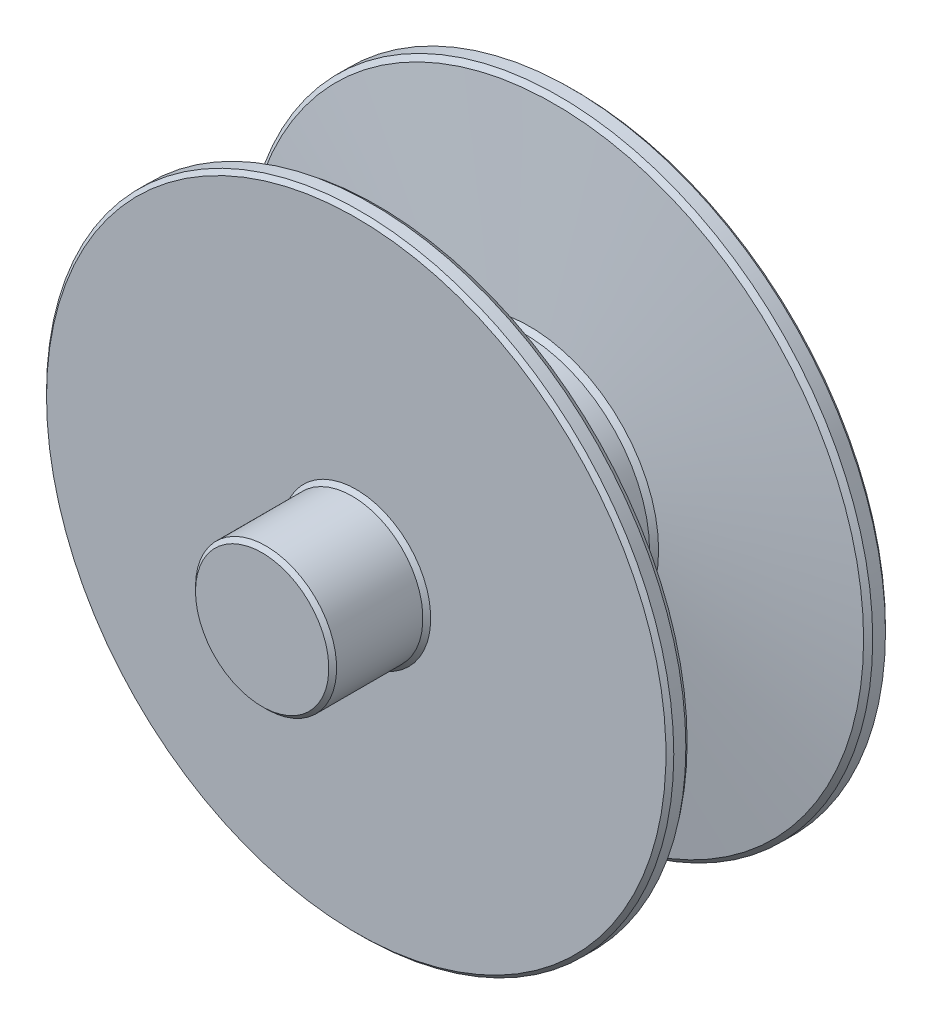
ISO-10303-21;
HEADER;
FILE_DESCRIPTION(('STEP AP214'),'2;1');
FILE_NAME('part.step','',(''),(''),'','','');
FILE_SCHEMA(('AUTOMOTIVE_DESIGN { 1 0 10303 214 1 1 1 1 }'));
ENDSEC;
DATA;
#1=APPLICATION_CONTEXT('core data for automotive mechanical design processes');
#2=APPLICATION_PROTOCOL_DEFINITION('international standard','automotive_design',2000,#1);
#3=PRODUCT_CONTEXT('',#1,'mechanical');
#4=PRODUCT('Part','Part','',(#3));
#5=PRODUCT_RELATED_PRODUCT_CATEGORY('part','',(#4));
#6=PRODUCT_DEFINITION_FORMATION('','',#4);
#7=PRODUCT_DEFINITION_CONTEXT('part definition',#1,'design');
#8=PRODUCT_DEFINITION('design','',#6,#7);
#9=PRODUCT_DEFINITION_SHAPE('','',#8);
#10=(LENGTH_UNIT() NAMED_UNIT(*) SI_UNIT(.MILLI.,.METRE.));
#11=(NAMED_UNIT(*) PLANE_ANGLE_UNIT() SI_UNIT($,.RADIAN.));
#12=(NAMED_UNIT(*) SI_UNIT($,.STERADIAN.) SOLID_ANGLE_UNIT());
#13=UNCERTAINTY_MEASURE_WITH_UNIT(LENGTH_MEASURE(1.E-05),#10,'distance_accuracy_value','');
#14=(GEOMETRIC_REPRESENTATION_CONTEXT(3) GLOBAL_UNCERTAINTY_ASSIGNED_CONTEXT((#13)) GLOBAL_UNIT_ASSIGNED_CONTEXT((#10,
#11,#12)) REPRESENTATION_CONTEXT('',''));
#15=CARTESIAN_POINT('',(0.,0.,0.));
#16=DIRECTION('',(0.,0.,1.));
#17=DIRECTION('',(1.,0.,0.));
#18=AXIS2_PLACEMENT_3D('',#15,#16,#17);
#19=CARTESIAN_POINT('',(0.,4.5,0.));
#20=DIRECTION('',(0.,0.,-1.));
#21=DIRECTION('',(-1.,0.,0.));
#22=AXIS2_PLACEMENT_3D('',#19,#20,#21);
#23=PLANE('',#22);
#24=CARTESIAN_POINT('',(0.,0.,0.));
#25=DIRECTION('',(0.,0.,-1.));
#26=DIRECTION('',(-1.,0.,0.));
#27=AXIS2_PLACEMENT_3D('',#24,#25,#26);
#28=CIRCLE('',#27,4.25);
#29=CARTESIAN_POINT('',(-4.25,0.,0.));
#30=VERTEX_POINT('',#29);
#31=EDGE_CURVE('E10',#30,#30,#28,.F.);
#32=ORIENTED_EDGE('',*,*,#31,.T.);
#33=EDGE_LOOP('',(#32));
#34=FACE_BOUND('',#33,.T.);
#35=ADVANCED_FACE('F29',(#34),#23,.F.);
#36=CARTESIAN_POINT('',(0.,0.,-26.));
#37=DIRECTION('',(0.,0.,1.));
#38=DIRECTION('',(1.,0.,0.));
#39=AXIS2_PLACEMENT_3D('',#36,#37,#38);
#40=PLANE('',#39);
#41=CARTESIAN_POINT('',(0.,0.,-26.));
#42=DIRECTION('',(0.,0.,1.));
#43=DIRECTION('',(1.,0.,0.));
#44=AXIS2_PLACEMENT_3D('',#41,#42,#43);
#45=CIRCLE('',#44,4.25);
#46=CARTESIAN_POINT('',(4.25,0.,-26.));
#47=VERTEX_POINT('',#46);
#48=EDGE_CURVE('E44',#47,#47,#45,.F.);
#49=ORIENTED_EDGE('',*,*,#48,.T.);
#50=EDGE_LOOP('',(#49));
#51=FACE_BOUND('',#50,.T.);
#52=ADVANCED_FACE('F152',(#51),#40,.F.);
#53=CARTESIAN_POINT('',(0.,0.,0.));
#54=DIRECTION('',(0.,0.,1.));
#55=DIRECTION('',(1.,0.,0.));
#56=AXIS2_PLACEMENT_3D('',#53,#54,#55);
#57=CYLINDRICAL_SURFACE('',#56,4.5);
#58=CARTESIAN_POINT('',(0.,0.,-25.75));
#59=DIRECTION('',(0.,0.,1.));
#60=DIRECTION('',(1.,0.,0.));
#61=AXIS2_PLACEMENT_3D('',#58,#59,#60);
#62=CIRCLE('',#61,4.5);
#63=CARTESIAN_POINT('',(4.5,0.,-25.75));
#64=VERTEX_POINT('',#63);
#65=EDGE_CURVE('E49',#64,#64,#62,.T.);
#66=ORIENTED_EDGE('',*,*,#65,.T.);
#67=EDGE_LOOP('',(#66));
#68=FACE_BOUND('',#67,.T.);
#69=CARTESIAN_POINT('',(0.,0.,-20.25));
#70=DIRECTION('',(0.,0.,1.));
#71=DIRECTION('',(1.,0.,0.));
#72=AXIS2_PLACEMENT_3D('',#69,#70,#71);
#73=CIRCLE('',#72,4.5);
#74=CARTESIAN_POINT('',(4.5,0.,-20.25));
#75=VERTEX_POINT('',#74);
#76=EDGE_CURVE('E52',#75,#75,#73,.F.);
#77=ORIENTED_EDGE('',*,*,#76,.T.);
#78=EDGE_LOOP('',(#77));
#79=FACE_BOUND('',#78,.T.);
#80=ADVANCED_FACE('F157',(#68,#79),#57,.T.);
#81=CARTESIAN_POINT('',(0.,4.5,-20.));
#82=DIRECTION('',(0.,0.,1.));
#83=DIRECTION('',(1.,0.,0.));
#84=AXIS2_PLACEMENT_3D('',#81,#82,#83);
#85=PLANE('',#84);
#86=CARTESIAN_POINT('',(0.,0.,-20.));
#87=DIRECTION('',(0.,0.,1.));
#88=DIRECTION('',(1.,0.,0.));
#89=AXIS2_PLACEMENT_3D('',#86,#87,#88);
#90=CIRCLE('',#89,19.75);
#91=CARTESIAN_POINT('',(19.75,0.,-20.));
#92=VERTEX_POINT('',#91);
#93=EDGE_CURVE('E55',#92,#92,#90,.F.);
#94=ORIENTED_EDGE('',*,*,#93,.T.);
#95=EDGE_LOOP('',(#94));
#96=FACE_BOUND('',#95,.T.);
#97=CARTESIAN_POINT('',(0.,0.,-20.));
#98=DIRECTION('',(0.,0.,1.));
#99=DIRECTION('',(1.,0.,0.));
#100=AXIS2_PLACEMENT_3D('',#97,#98,#99);
#101=CIRCLE('',#100,4.75);
#102=CARTESIAN_POINT('',(4.75,0.,-20.));
#103=VERTEX_POINT('',#102);
#104=EDGE_CURVE('E58',#103,#103,#101,.T.);
#105=ORIENTED_EDGE('',*,*,#104,.T.);
#106=EDGE_LOOP('',(#105));
#107=FACE_BOUND('',#106,.T.);
#108=ADVANCED_FACE('F182',(#96,#107),#85,.F.);
#109=CARTESIAN_POINT('',(0.,0.,0.));
#110=DIRECTION('',(0.,0.,1.));
#111=DIRECTION('',(1.,0.,0.));
#112=AXIS2_PLACEMENT_3D('',#109,#110,#111);
#113=CYLINDRICAL_SURFACE('',#112,20.);
#114=CARTESIAN_POINT('',(0.,0.,-19.75));
#115=DIRECTION('',(0.,0.,1.));
#116=DIRECTION('',(1.,0.,0.));
#117=AXIS2_PLACEMENT_3D('',#114,#115,#116);
#118=CIRCLE('',#117,20.);
#119=CARTESIAN_POINT('',(20.,0.,-19.75));
#120=VERTEX_POINT('',#119);
#121=EDGE_CURVE('E61',#120,#120,#118,.T.);
#122=ORIENTED_EDGE('',*,*,#121,.T.);
#123=EDGE_LOOP('',(#122));
#124=FACE_BOUND('',#123,.T.);
#125=CARTESIAN_POINT('',(0.,0.,-18.9364900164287));
#126=DIRECTION('',(0.,0.,-1.));
#127=DIRECTION('',(-1.,0.,0.));
#128=AXIS2_PLACEMENT_3D('',#125,#126,#127);
#129=CIRCLE('',#128,20.);
#130=CARTESIAN_POINT('',(-20.,0.,-18.9364900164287));
#131=VERTEX_POINT('',#130);
#132=EDGE_CURVE('E64',#131,#131,#129,.T.);
#133=ORIENTED_EDGE('',*,*,#132,.T.);
#134=EDGE_LOOP('',(#133));
#135=FACE_BOUND('',#134,.T.);
#136=ADVANCED_FACE('F188',(#124,#135),#113,.T.);
#137=CARTESIAN_POINT('',(0.,0.,-18.6864900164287));
#138=DIRECTION('',(0.,0.,-1.));
#139=DIRECTION('',(-1.,0.,0.));
#140=AXIS2_PLACEMENT_3D('',#137,#138,#139);
#141=CONICAL_SURFACE('',#140,20.,1.43116998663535);
#142=CARTESIAN_POINT('',(0.,0.,-17.03479327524));
#143=DIRECTION('',(0.,0.,-1.));
#144=DIRECTION('',(-1.,0.,0.));
#145=AXIS2_PLACEMENT_3D('',#142,#143,#144);
#146=CIRCLE('',#145,8.24756701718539);
#147=CARTESIAN_POINT('',(-8.24756701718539,0.,-17.03479327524));
#148=VERTEX_POINT('',#147);
#149=EDGE_CURVE('E85',#148,#148,#146,.T.);
#150=ORIENTED_EDGE('',*,*,#149,.T.);
#151=EDGE_LOOP('',(#150));
#152=FACE_BOUND('',#151,.T.);
#153=CARTESIAN_POINT('',(0.,0.,-18.6456094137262));
#154=DIRECTION('',(0.,0.,1.));
#155=DIRECTION('',(1.,0.,0.));
#156=AXIS2_PLACEMENT_3D('',#153,#154,#155);
#157=CIRCLE('',#156,19.7091193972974);
#158=CARTESIAN_POINT('',(19.7091193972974,0.,-18.6456094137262));
#159=VERTEX_POINT('',#158);
#160=EDGE_CURVE('E88',#159,#159,#157,.T.);
#161=ORIENTED_EDGE('',*,*,#160,.T.);
#162=EDGE_LOOP('',(#161));
#163=FACE_BOUND('',#162,.T.);
#164=ADVANCED_FACE('F194',(#152,#163),#141,.T.);
#165=CARTESIAN_POINT('',(0.,0.,0.));
#166=DIRECTION('',(0.,0.,1.));
#167=DIRECTION('',(1.,0.,0.));
#168=AXIS2_PLACEMENT_3D('',#165,#166,#167);
#169=CYLINDRICAL_SURFACE('',#168,8.);
#170=CARTESIAN_POINT('',(0.,0.,-16.7062607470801));
#171=DIRECTION('',(0.,0.,-1.));
#172=DIRECTION('',(-1.,0.,0.));
#173=AXIS2_PLACEMENT_3D('',#170,#171,#172);
#174=CIRCLE('',#173,8.);
#175=CARTESIAN_POINT('',(-8.,0.,-16.7062607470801));
#176=VERTEX_POINT('',#175);
#177=EDGE_CURVE('E91',#176,#176,#174,.F.);
#178=ORIENTED_EDGE('',*,*,#177,.T.);
#179=EDGE_LOOP('',(#178));
#180=FACE_BOUND('',#179,.T.);
#181=CARTESIAN_POINT('',(0.,0.,-9.25));
#182=DIRECTION('',(0.,0.,1.));
#183=DIRECTION('',(1.,0.,0.));
#184=AXIS2_PLACEMENT_3D('',#181,#182,#183);
#185=CIRCLE('',#184,8.);
#186=CARTESIAN_POINT('',(8.,0.,-9.25));
#187=VERTEX_POINT('',#186);
#188=EDGE_CURVE('E94',#187,#187,#185,.F.);
#189=ORIENTED_EDGE('',*,*,#188,.T.);
#190=EDGE_LOOP('',(#189));
#191=FACE_BOUND('',#190,.T.);
#192=ADVANCED_FACE('F98',(#180,#191),#169,.T.);
#193=CARTESIAN_POINT('',(0.,0.,-9.));
#194=DIRECTION('',(0.,0.,1.));
#195=DIRECTION('',(1.,0.,0.));
#196=AXIS2_PLACEMENT_3D('',#193,#194,#195);
#197=CONICAL_SURFACE('',#196,8.,1.43116998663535);
#198=CARTESIAN_POINT('',(0.,0.,-8.95911939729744));
#199=DIRECTION('',(0.,0.,1.));
#200=DIRECTION('',(1.,0.,0.));
#201=AXIS2_PLACEMENT_3D('',#198,#199,#200);
#202=CIRCLE('',#201,8.29088060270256);
#203=CARTESIAN_POINT('',(8.29088060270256,0.,-8.95911939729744));
#204=VERTEX_POINT('',#203);
#205=EDGE_CURVE('E79',#204,#204,#202,.T.);
#206=ORIENTED_EDGE('',*,*,#205,.T.);
#207=EDGE_LOOP('',(#206));
#208=FACE_BOUND('',#207,.T.);
#209=CARTESIAN_POINT('',(0.,0.,-7.34830325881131));
#210=DIRECTION('',(0.,0.,-1.));
#211=DIRECTION('',(-1.,0.,0.));
#212=AXIS2_PLACEMENT_3D('',#209,#210,#211);
#213=CIRCLE('',#212,19.7524329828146);
#214=CARTESIAN_POINT('',(-19.7524329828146,0.,-7.34830325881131));
#215=VERTEX_POINT('',#214);
#216=EDGE_CURVE('E82',#215,#215,#213,.T.);
#217=ORIENTED_EDGE('',*,*,#216,.T.);
#218=EDGE_LOOP('',(#217));
#219=FACE_BOUND('',#218,.T.);
#220=ADVANCED_FACE('F108',(#208,#219),#197,.T.);
#221=CARTESIAN_POINT('',(0.,0.,0.));
#222=DIRECTION('',(0.,0.,1.));
#223=DIRECTION('',(1.,0.,0.));
#224=AXIS2_PLACEMENT_3D('',#221,#222,#223);
#225=CYLINDRICAL_SURFACE('',#224,20.);
#226=CARTESIAN_POINT('',(0.,0.,-7.01977073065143));
#227=DIRECTION('',(0.,0.,1.));
#228=DIRECTION('',(1.,0.,0.));
#229=AXIS2_PLACEMENT_3D('',#226,#227,#228);
#230=CIRCLE('',#229,20.);
#231=CARTESIAN_POINT('',(20.,0.,-7.01977073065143));
#232=VERTEX_POINT('',#231);
#233=EDGE_CURVE('E73',#232,#232,#230,.T.);
#234=ORIENTED_EDGE('',*,*,#233,.T.);
#235=EDGE_LOOP('',(#234));
#236=FACE_BOUND('',#235,.T.);
#237=CARTESIAN_POINT('',(0.,0.,-6.25));
#238=DIRECTION('',(0.,0.,-1.));
#239=DIRECTION('',(-1.,0.,0.));
#240=AXIS2_PLACEMENT_3D('',#237,#238,#239);
#241=CIRCLE('',#240,20.);
#242=CARTESIAN_POINT('',(-20.,0.,-6.25));
#243=VERTEX_POINT('',#242);
#244=EDGE_CURVE('E76',#243,#243,#241,.T.);
#245=ORIENTED_EDGE('',*,*,#244,.T.);
#246=EDGE_LOOP('',(#245));
#247=FACE_BOUND('',#246,.T.);
#248=ADVANCED_FACE('F111',(#236,#247),#225,.T.);
#249=CARTESIAN_POINT('',(0.,20.,-6.));
#250=DIRECTION('',(0.,0.,-1.));
#251=DIRECTION('',(-1.,0.,0.));
#252=AXIS2_PLACEMENT_3D('',#249,#250,#251);
#253=PLANE('',#252);
#254=CARTESIAN_POINT('',(0.,0.,-6.));
#255=DIRECTION('',(0.,0.,-1.));
#256=DIRECTION('',(-1.,0.,0.));
#257=AXIS2_PLACEMENT_3D('',#254,#255,#256);
#258=CIRCLE('',#257,19.75);
#259=CARTESIAN_POINT('',(-19.75,0.,-6.));
#260=VERTEX_POINT('',#259);
#261=EDGE_CURVE('E67',#260,#260,#258,.F.);
#262=ORIENTED_EDGE('',*,*,#261,.T.);
#263=EDGE_LOOP('',(#262));
#264=FACE_BOUND('',#263,.T.);
#265=CARTESIAN_POINT('',(0.,0.,-6.));
#266=DIRECTION('',(0.,0.,-1.));
#267=DIRECTION('',(-1.,0.,0.));
#268=AXIS2_PLACEMENT_3D('',#265,#266,#267);
#269=CIRCLE('',#268,4.75);
#270=CARTESIAN_POINT('',(-4.75,0.,-6.));
#271=VERTEX_POINT('',#270);
#272=EDGE_CURVE('E70',#271,#271,#269,.T.);
#273=ORIENTED_EDGE('',*,*,#272,.T.);
#274=EDGE_LOOP('',(#273));
#275=FACE_BOUND('',#274,.T.);
#276=ADVANCED_FACE('F123',(#264,#275),#253,.F.);
#277=CARTESIAN_POINT('',(0.,0.,0.));
#278=DIRECTION('',(0.,0.,1.));
#279=DIRECTION('',(1.,0.,0.));
#280=AXIS2_PLACEMENT_3D('',#277,#278,#279);
#281=CYLINDRICAL_SURFACE('',#280,4.5);
#282=CARTESIAN_POINT('',(0.,0.,-5.75));
#283=DIRECTION('',(0.,0.,-1.));
#284=DIRECTION('',(-1.,0.,0.));
#285=AXIS2_PLACEMENT_3D('',#282,#283,#284);
#286=CIRCLE('',#285,4.5);
#287=CARTESIAN_POINT('',(-4.5,0.,-5.75));
#288=VERTEX_POINT('',#287);
#289=EDGE_CURVE('E36',#288,#288,#286,.F.);
#290=ORIENTED_EDGE('',*,*,#289,.T.);
#291=EDGE_LOOP('',(#290));
#292=FACE_BOUND('',#291,.T.);
#293=CARTESIAN_POINT('',(0.,0.,-0.250000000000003));
#294=DIRECTION('',(0.,0.,-1.));
#295=DIRECTION('',(-1.,0.,0.));
#296=AXIS2_PLACEMENT_3D('',#293,#294,#295);
#297=CIRCLE('',#296,4.5);
#298=CARTESIAN_POINT('',(-4.5,0.,-0.250000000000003));
#299=VERTEX_POINT('',#298);
#300=EDGE_CURVE('E40',#299,#299,#297,.T.);
#301=ORIENTED_EDGE('',*,*,#300,.T.);
#302=EDGE_LOOP('',(#301));
#303=FACE_BOUND('',#302,.T.);
#304=ADVANCED_FACE('F135',(#292,#303),#281,.T.);
#305=CARTESIAN_POINT('',(0.,0.,-16.7062607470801));
#306=DIRECTION('',(0.,0.,-1.));
#307=DIRECTION('',(-1.,0.,0.));
#308=AXIS2_PLACEMENT_3D('',#305,#306,#307);
#309=CONICAL_SURFACE('',#308,8.,0.645771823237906);
#310=ORIENTED_EDGE('',*,*,#149,.F.);
#311=EDGE_LOOP('',(#310));
#312=FACE_BOUND('',#311,.T.);
#313=ORIENTED_EDGE('',*,*,#177,.F.);
#314=EDGE_LOOP('',(#313));
#315=FACE_BOUND('',#314,.T.);
#316=ADVANCED_FACE('F104',(#312,#315),#309,.T.);
#317=CARTESIAN_POINT('',(0.,0.,-8.95911939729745));
#318=DIRECTION('',(0.,0.,1.));
#319=DIRECTION('',(1.,0.,0.));
#320=AXIS2_PLACEMENT_3D('',#317,#318,#319);
#321=CONICAL_SURFACE('',#320,8.29088060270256,0.785398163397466);
#322=ORIENTED_EDGE('',*,*,#188,.F.);
#323=EDGE_LOOP('',(#322));
#324=FACE_BOUND('',#323,.T.);
#325=ORIENTED_EDGE('',*,*,#205,.F.);
#326=EDGE_LOOP('',(#325));
#327=FACE_BOUND('',#326,.T.);
#328=ADVANCED_FACE('F100',(#324,#327),#321,.T.);
#329=CARTESIAN_POINT('',(0.,0.,-7.01977073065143));
#330=DIRECTION('',(0.,0.,1.));
#331=DIRECTION('',(1.,0.,0.));
#332=AXIS2_PLACEMENT_3D('',#329,#330,#331);
#333=CONICAL_SURFACE('',#332,20.,0.645771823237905);
#334=ORIENTED_EDGE('',*,*,#216,.F.);
#335=EDGE_LOOP('',(#334));
#336=FACE_BOUND('',#335,.T.);
#337=ORIENTED_EDGE('',*,*,#233,.F.);
#338=EDGE_LOOP('',(#337));
#339=FACE_BOUND('',#338,.T.);
#340=ADVANCED_FACE('F103',(#336,#339),#333,.T.);
#341=CARTESIAN_POINT('',(0.,0.,-6.));
#342=DIRECTION('',(0.,0.,-1.));
#343=DIRECTION('',(-1.,0.,0.));
#344=AXIS2_PLACEMENT_3D('',#341,#342,#343);
#345=CONICAL_SURFACE('',#344,19.75,0.785398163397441);
#346=ORIENTED_EDGE('',*,*,#244,.F.);
#347=EDGE_LOOP('',(#346));
#348=FACE_BOUND('',#347,.T.);
#349=ORIENTED_EDGE('',*,*,#261,.F.);
#350=EDGE_LOOP('',(#349));
#351=FACE_BOUND('',#350,.T.);
#352=ADVANCED_FACE('F117',(#348,#351),#345,.T.);
#353=CARTESIAN_POINT('',(0.,0.,-19.75));
#354=DIRECTION('',(0.,0.,1.));
#355=DIRECTION('',(1.,0.,0.));
#356=AXIS2_PLACEMENT_3D('',#353,#354,#355);
#357=CONICAL_SURFACE('',#356,20.,0.785398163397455);
#358=ORIENTED_EDGE('',*,*,#93,.F.);
#359=EDGE_LOOP('',(#358));
#360=FACE_BOUND('',#359,.T.);
#361=ORIENTED_EDGE('',*,*,#121,.F.);
#362=EDGE_LOOP('',(#361));
#363=FACE_BOUND('',#362,.T.);
#364=ADVANCED_FACE('F129',(#360,#363),#357,.T.);
#365=CARTESIAN_POINT('',(0.,0.,-18.6456094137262));
#366=DIRECTION('',(0.,0.,-1.));
#367=DIRECTION('',(-1.,0.,0.));
#368=AXIS2_PLACEMENT_3D('',#365,#366,#367);
#369=CONICAL_SURFACE('',#368,19.7091193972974,0.785398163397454);
#370=ORIENTED_EDGE('',*,*,#132,.F.);
#371=EDGE_LOOP('',(#370));
#372=FACE_BOUND('',#371,.T.);
#373=ORIENTED_EDGE('',*,*,#160,.F.);
#374=EDGE_LOOP('',(#373));
#375=FACE_BOUND('',#374,.T.);
#376=ADVANCED_FACE('F167',(#372,#375),#369,.T.);
#377=CARTESIAN_POINT('',(0.,0.,-25.75));
#378=DIRECTION('',(0.,0.,1.));
#379=DIRECTION('',(1.,0.,0.));
#380=AXIS2_PLACEMENT_3D('',#377,#378,#379);
#381=CONICAL_SURFACE('',#380,4.5,0.785398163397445);
#382=ORIENTED_EDGE('',*,*,#48,.F.);
#383=EDGE_LOOP('',(#382));
#384=FACE_BOUND('',#383,.T.);
#385=ORIENTED_EDGE('',*,*,#65,.F.);
#386=EDGE_LOOP('',(#385));
#387=FACE_BOUND('',#386,.T.);
#388=ADVANCED_FACE('F148',(#384,#387),#381,.T.);
#389=CARTESIAN_POINT('',(0.,0.,-20.));
#390=DIRECTION('',(0.,0.,1.));
#391=DIRECTION('',(1.,0.,0.));
#392=AXIS2_PLACEMENT_3D('',#389,#390,#391);
#393=CONICAL_SURFACE('',#392,4.75,0.785398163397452);
#394=ORIENTED_EDGE('',*,*,#76,.F.);
#395=EDGE_LOOP('',(#394));
#396=FACE_BOUND('',#395,.T.);
#397=ORIENTED_EDGE('',*,*,#104,.F.);
#398=EDGE_LOOP('',(#397));
#399=FACE_BOUND('',#398,.T.);
#400=ADVANCED_FACE('F142',(#396,#399),#393,.T.);
#401=CARTESIAN_POINT('',(0.,0.,-5.75));
#402=DIRECTION('',(0.,0.,-1.));
#403=DIRECTION('',(-1.,0.,0.));
#404=AXIS2_PLACEMENT_3D('',#401,#402,#403);
#405=CONICAL_SURFACE('',#404,4.5,0.785398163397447);
#406=ORIENTED_EDGE('',*,*,#272,.F.);
#407=EDGE_LOOP('',(#406));
#408=FACE_BOUND('',#407,.T.);
#409=ORIENTED_EDGE('',*,*,#289,.F.);
#410=EDGE_LOOP('',(#409));
#411=FACE_BOUND('',#410,.T.);
#412=ADVANCED_FACE('F139',(#408,#411),#405,.T.);
#413=CARTESIAN_POINT('',(0.,0.,0.));
#414=DIRECTION('',(0.,0.,-1.));
#415=DIRECTION('',(-1.,0.,0.));
#416=AXIS2_PLACEMENT_3D('',#413,#414,#415);
#417=CONICAL_SURFACE('',#416,4.25,0.785398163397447);
#418=ORIENTED_EDGE('',*,*,#300,.F.);
#419=EDGE_LOOP('',(#418));
#420=FACE_BOUND('',#419,.T.);
#421=ORIENTED_EDGE('',*,*,#31,.F.);
#422=EDGE_LOOP('',(#421));
#423=FACE_BOUND('',#422,.T.);
#424=ADVANCED_FACE('F31',(#420,#423),#417,.T.);
#425=CLOSED_SHELL('',(#35,#52,#80,#108,#136,#164,#192,#220,#248,#276,#304,#316,#328,#340,#352,
#364,#376,#388,#400,#412,#424));
#426=MANIFOLD_SOLID_BREP('B2',#425);
#427=ADVANCED_BREP_SHAPE_REPRESENTATION('',(#18,#426),#14);
#428=SHAPE_DEFINITION_REPRESENTATION(#9,#427);
ENDSEC;
END-ISO-10303-21;
